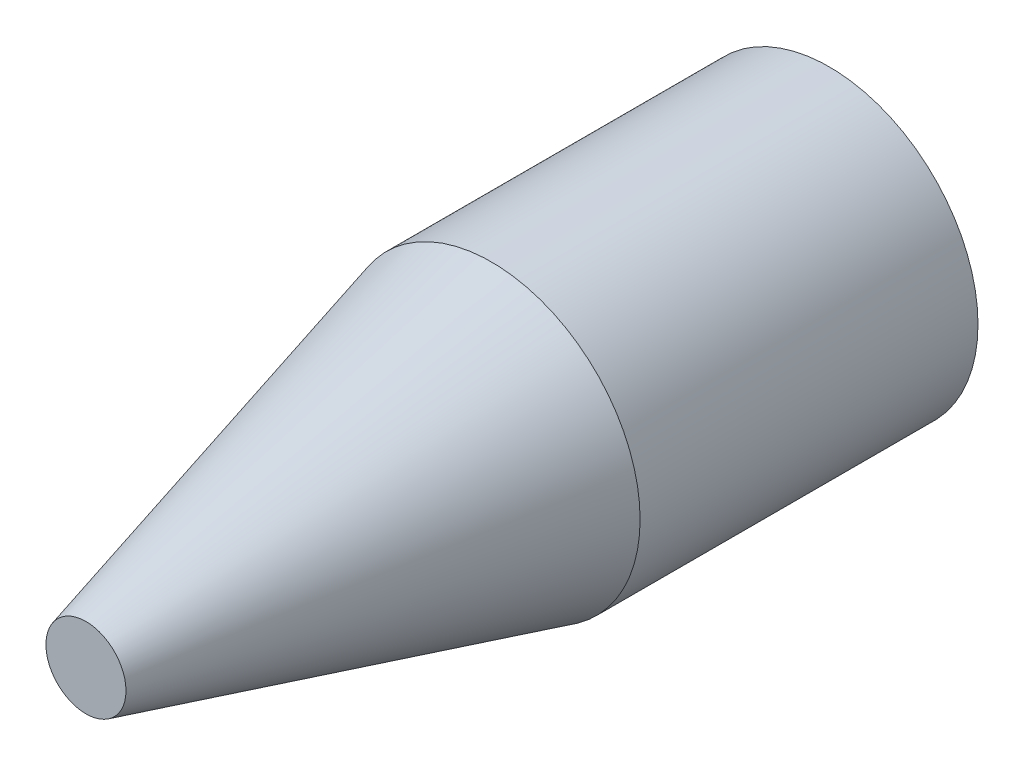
ISO-10303-21;
HEADER;
FILE_DESCRIPTION(('STEP AP214'),'2;1');
FILE_NAME('part.step','',(''),(''),'','','');
FILE_SCHEMA(('AUTOMOTIVE_DESIGN { 1 0 10303 214 1 1 1 1 }'));
ENDSEC;
DATA;
#1=APPLICATION_CONTEXT('core data for automotive mechanical design processes');
#2=APPLICATION_PROTOCOL_DEFINITION('international standard','automotive_design',2000,#1);
#3=PRODUCT_CONTEXT('',#1,'mechanical');
#4=PRODUCT('Part','Part','',(#3));
#5=PRODUCT_RELATED_PRODUCT_CATEGORY('part','',(#4));
#6=PRODUCT_DEFINITION_FORMATION('','',#4);
#7=PRODUCT_DEFINITION_CONTEXT('part definition',#1,'design');
#8=PRODUCT_DEFINITION('design','',#6,#7);
#9=PRODUCT_DEFINITION_SHAPE('','',#8);
#10=(LENGTH_UNIT() NAMED_UNIT(*) SI_UNIT(.MILLI.,.METRE.));
#11=(NAMED_UNIT(*) PLANE_ANGLE_UNIT() SI_UNIT($,.RADIAN.));
#12=(NAMED_UNIT(*) SI_UNIT($,.STERADIAN.) SOLID_ANGLE_UNIT());
#13=UNCERTAINTY_MEASURE_WITH_UNIT(LENGTH_MEASURE(1.E-05),#10,'distance_accuracy_value','');
#14=(GEOMETRIC_REPRESENTATION_CONTEXT(3) GLOBAL_UNCERTAINTY_ASSIGNED_CONTEXT((#13)) GLOBAL_UNIT_ASSIGNED_CONTEXT((#10,
#11,#12)) REPRESENTATION_CONTEXT('',''));
#15=CARTESIAN_POINT('',(0.,0.,0.));
#16=DIRECTION('',(0.,0.,1.));
#17=DIRECTION('',(1.,0.,0.));
#18=AXIS2_PLACEMENT_3D('',#15,#16,#17);
#19=CARTESIAN_POINT('',(0.,0.,0.));
#20=DIRECTION('',(0.,0.,-1.));
#21=DIRECTION('',(1.,0.,0.));
#22=AXIS2_PLACEMENT_3D('',#19,#20,#21);
#23=CONICAL_SURFACE('',#22,110.,0.26179938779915);
#24=CARTESIAN_POINT('',(0.,0.,300.));
#25=DIRECTION('',(0.,0.,1.));
#26=DIRECTION('',(1.,0.,0.));
#27=AXIS2_PLACEMENT_3D('',#24,#25,#26);
#28=CIRCLE('',#27,29.615242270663);
#29=CARTESIAN_POINT('',(29.615242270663,0.,300.));
#30=VERTEX_POINT('',#29);
#31=EDGE_CURVE('E10',#30,#30,#28,.T.);
#32=CARTESIAN_POINT('',(0.,0.,0.));
#33=DIRECTION('',(0.,0.,-1.));
#34=DIRECTION('',(-1.,0.,0.));
#35=AXIS2_PLACEMENT_3D('',#32,#33,#34);
#36=CIRCLE('',#35,110.);
#37=CARTESIAN_POINT('',(110.,0.,0.));
#38=VERTEX_POINT('',#37);
#39=EDGE_CURVE('E376',#38,#38,#36,.T.);
#40=CARTESIAN_POINT('',(29.615242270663,0.,300.));
#41=CARTESIAN_POINT('',(30.4525834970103,0.,296.875));
#42=CARTESIAN_POINT('',(31.2899247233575,0.,293.75));
#43=CARTESIAN_POINT('',(32.9646071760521,0.,287.5));
#44=CARTESIAN_POINT('',(33.8019484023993,0.,284.375));
#45=CARTESIAN_POINT('',(35.4766308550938,0.,278.125));
#46=CARTESIAN_POINT('',(36.3139720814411,0.,275.));
#47=CARTESIAN_POINT('',(37.9886545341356,0.,268.75));
#48=CARTESIAN_POINT('',(38.8259957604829,0.,265.625));
#49=CARTESIAN_POINT('',(40.5006782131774,0.,259.375));
#50=CARTESIAN_POINT('',(41.3380194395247,0.,256.25));
#51=CARTESIAN_POINT('',(43.0127018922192,0.,250.));
#52=CARTESIAN_POINT('',(43.8500431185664,0.,246.875));
#53=CARTESIAN_POINT('',(45.524725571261,0.,240.625));
#54=CARTESIAN_POINT('',(46.3620667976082,0.,237.5));
#55=CARTESIAN_POINT('',(48.0367492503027,0.,231.25));
#56=CARTESIAN_POINT('',(48.87409047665,0.,228.125));
#57=CARTESIAN_POINT('',(50.5487729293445,0.,221.875));
#58=CARTESIAN_POINT('',(51.3861141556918,0.,218.75));
#59=CARTESIAN_POINT('',(53.0607966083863,0.,212.5));
#60=CARTESIAN_POINT('',(53.8981378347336,0.,209.375));
#61=CARTESIAN_POINT('',(55.5728202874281,0.,203.125));
#62=CARTESIAN_POINT('',(56.4101615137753,0.,200.));
#63=CARTESIAN_POINT('',(58.0848439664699,0.,193.75));
#64=CARTESIAN_POINT('',(58.9221851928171,0.,190.625));
#65=CARTESIAN_POINT('',(60.5968676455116,0.,184.375));
#66=CARTESIAN_POINT('',(61.4342088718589,0.,181.25));
#67=CARTESIAN_POINT('',(63.1088913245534,0.,175.));
#68=CARTESIAN_POINT('',(63.9462325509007,0.,171.875));
#69=CARTESIAN_POINT('',(65.6209150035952,0.,165.625));
#70=CARTESIAN_POINT('',(66.4582562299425,0.,162.5));
#71=CARTESIAN_POINT('',(68.132938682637,0.,156.25));
#72=CARTESIAN_POINT('',(68.9702799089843,0.,153.125));
#73=CARTESIAN_POINT('',(70.6449623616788,0.,146.875));
#74=CARTESIAN_POINT('',(71.482303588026,0.,143.75));
#75=CARTESIAN_POINT('',(73.1569860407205,0.,137.5));
#76=CARTESIAN_POINT('',(73.9943272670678,0.,134.375));
#77=CARTESIAN_POINT('',(75.6690097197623,0.,128.125));
#78=CARTESIAN_POINT('',(76.5063509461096,0.,125.));
#79=CARTESIAN_POINT('',(78.1810333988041,0.,118.75));
#80=CARTESIAN_POINT('',(79.0183746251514,0.,115.625));
#81=CARTESIAN_POINT('',(80.6930570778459,0.,109.375));
#82=CARTESIAN_POINT('',(81.5303983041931,0.,106.25));
#83=CARTESIAN_POINT('',(83.2050807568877,0.,100.));
#84=CARTESIAN_POINT('',(84.0424219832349,0.,96.875));
#85=CARTESIAN_POINT('',(85.7171044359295,0.,90.625));
#86=CARTESIAN_POINT('',(86.5544456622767,0.,87.5));
#87=CARTESIAN_POINT('',(88.2291281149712,0.,81.25));
#88=CARTESIAN_POINT('',(89.0664693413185,0.,78.125));
#89=CARTESIAN_POINT('',(90.741151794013,0.,71.875));
#90=CARTESIAN_POINT('',(91.5784930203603,0.,68.75));
#91=CARTESIAN_POINT('',(93.2531754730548,0.,62.5));
#92=CARTESIAN_POINT('',(94.090516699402,0.,59.375));
#93=CARTESIAN_POINT('',(95.7651991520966,0.,53.125));
#94=CARTESIAN_POINT('',(96.6025403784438,0.,50.));
#95=CARTESIAN_POINT('',(98.2772228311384,0.,43.75));
#96=CARTESIAN_POINT('',(99.1145640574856,0.,40.625));
#97=CARTESIAN_POINT('',(100.78924651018,0.,34.375));
#98=CARTESIAN_POINT('',(101.626587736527,0.,31.25));
#99=CARTESIAN_POINT('',(103.301270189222,0.,25.));
#100=CARTESIAN_POINT('',(104.138611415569,0.,21.875));
#101=CARTESIAN_POINT('',(105.813293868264,0.,15.625));
#102=CARTESIAN_POINT('',(106.650635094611,0.,12.5));
#103=CARTESIAN_POINT('',(108.325317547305,0.,6.25000000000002));
#104=CARTESIAN_POINT('',(109.162658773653,0.,3.12500000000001));
#105=CARTESIAN_POINT('',(110.,0.,0.));
#106=B_SPLINE_CURVE_WITH_KNOTS('',3,(#40,#41,#42,#43,#44,#45,#46,#47,#48,#49,#50,#51,#52,#53,
#54,#55,#56,#57,#58,#59,#60,#61,#62,#63,#64,#65,#66,#67,#68,#69,#70,#71,#72,#73,#74,#75,#76,#77,
#78,#79,#80,#81,#82,#83,#84,#85,#86,#87,#88,#89,#90,#91,#92,#93,#94,#95,#96,#97,#98,#99,#100,
#101,#102,#103,#104,#105),.UNSPECIFIED.,.F.,.F.,(4,2,2,2,2,2,2,2,2,2,2,2,2,2,2,2,2,2,2,2,2,2,2,
2,2,2,2,2,2,2,2,2,4),(0.,9.70571419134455,19.411428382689,29.1171425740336,38.8228567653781,
48.5285709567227,58.2342851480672,67.9399993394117,77.6457135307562,87.3514277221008,
97.0571419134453,106.76285610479,116.468570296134,126.174284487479,135.879998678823,
145.585712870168,155.291427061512,164.997141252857,174.702855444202,184.408569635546,
194.114283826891,203.819998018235,213.52571220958,223.231426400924,232.937140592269,
242.642854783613,252.348568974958,262.054283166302,271.759997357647,281.465711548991,
291.171425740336,300.87713993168,310.582854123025),.UNSPECIFIED.);
#107=EDGE_CURVE('BSEAM366',#30,#38,#106,.T.);
#108=ORIENTED_EDGE('',*,*,#31,.F.);
#109=ORIENTED_EDGE('',*,*,#39,.F.);
#110=ORIENTED_EDGE('',*,*,#107,.T.);
#111=ORIENTED_EDGE('',*,*,#107,.F.);
#112=EDGE_LOOP('',(#108,#110,#109,#111));
#113=FACE_BOUND('',#112,.T.);
#114=ADVANCED_FACE('F366',(#113),#23,.T.);
#115=CARTESIAN_POINT('',(0.,0.,300.));
#116=DIRECTION('',(0.,0.,1.));
#117=DIRECTION('',(1.,0.,0.));
#118=AXIS2_PLACEMENT_3D('',#115,#116,#117);
#119=PLANE('',#118);
#120=ORIENTED_EDGE('',*,*,#31,.T.);
#121=EDGE_LOOP('',(#120));
#122=FACE_BOUND('',#121,.T.);
#123=ADVANCED_FACE('F408',(#122),#119,.T.);
#124=CARTESIAN_POINT('',(0.,0.,-250.));
#125=DIRECTION('',(0.,0.,1.));
#126=DIRECTION('',(1.,0.,0.));
#127=AXIS2_PLACEMENT_3D('',#124,#125,#126);
#128=CYLINDRICAL_SURFACE('',#127,110.);
#129=CARTESIAN_POINT('',(0.,0.,-250.));
#130=DIRECTION('',(0.,0.,-1.));
#131=DIRECTION('',(-1.,0.,0.));
#132=AXIS2_PLACEMENT_3D('',#129,#130,#131);
#133=CIRCLE('',#132,110.);
#134=CARTESIAN_POINT('',(-110.,0.,-250.));
#135=VERTEX_POINT('',#134);
#136=EDGE_CURVE('E372',#135,#135,#133,.T.);
#137=ORIENTED_EDGE('',*,*,#136,.F.);
#138=EDGE_LOOP('',(#137));
#139=FACE_BOUND('',#138,.T.);
#140=ORIENTED_EDGE('',*,*,#39,.T.);
#141=EDGE_LOOP('',(#140));
#142=FACE_BOUND('',#141,.T.);
#143=ADVANCED_FACE('F413',(#139,#142),#128,.T.);
#144=CARTESIAN_POINT('',(0.,0.,-250.));
#145=DIRECTION('',(0.,0.,-1.));
#146=DIRECTION('',(-1.,0.,0.));
#147=AXIS2_PLACEMENT_3D('',#144,#145,#146);
#148=PLANE('',#147);
#149=CARTESIAN_POINT('',(0.,0.,-250.));
#150=DIRECTION('',(0.,0.,-1.));
#151=DIRECTION('',(-1.,0.,0.));
#152=AXIS2_PLACEMENT_3D('',#149,#150,#151);
#153=CIRCLE('',#152,105.);
#154=CARTESIAN_POINT('',(-105.,0.,-250.));
#155=VERTEX_POINT('',#154);
#156=EDGE_CURVE('E383',#155,#155,#153,.T.);
#157=ORIENTED_EDGE('',*,*,#156,.F.);
#158=EDGE_LOOP('',(#157));
#159=FACE_BOUND('',#158,.T.);
#160=ORIENTED_EDGE('',*,*,#136,.T.);
#161=EDGE_LOOP('',(#160));
#162=FACE_BOUND('',#161,.T.);
#163=ADVANCED_FACE('F405',(#159,#162),#148,.T.);
#164=CARTESIAN_POINT('',(0.,0.,-1.29409522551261));
#165=DIRECTION('',(0.,0.,-1.));
#166=DIRECTION('',(1.,0.,0.));
#167=AXIS2_PLACEMENT_3D('',#164,#165,#166);
#168=CONICAL_SURFACE('',#167,105.170370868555,0.26179938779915);
#169=CARTESIAN_POINT('',(0.,0.,295.));
#170=DIRECTION('',(0.,0.,1.));
#171=DIRECTION('',(1.,0.,0.));
#172=AXIS2_PLACEMENT_3D('',#169,#170,#171);
#173=CIRCLE('',#172,25.7786073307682);
#174=CARTESIAN_POINT('',(25.7786073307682,0.,295.));
#175=VERTEX_POINT('',#174);
#176=EDGE_CURVE('E380',#175,#175,#173,.T.);
#177=CARTESIAN_POINT('',(0.,0.,-0.658262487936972));
#178=DIRECTION('',(0.,0.,-1.));
#179=DIRECTION('',(-1.,0.,0.));
#180=AXIS2_PLACEMENT_3D('',#177,#178,#179);
#181=CIRCLE('',#180,105.);
#182=CARTESIAN_POINT('',(105.,0.,-0.658262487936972));
#183=VERTEX_POINT('',#182);
#184=EDGE_CURVE('E386',#183,#183,#181,.T.);
#185=CARTESIAN_POINT('',(25.7786073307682,0.,295.));
#186=CARTESIAN_POINT('',(26.6038301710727,0.,291.920226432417));
#187=CARTESIAN_POINT('',(27.4290530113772,0.,288.840452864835));
#188=CARTESIAN_POINT('',(29.0794986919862,0.,282.680905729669));
#189=CARTESIAN_POINT('',(29.9047215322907,0.,279.601132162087));
#190=CARTESIAN_POINT('',(31.5551672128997,0.,273.441585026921));
#191=CARTESIAN_POINT('',(32.3803900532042,0.,270.361811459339));
#192=CARTESIAN_POINT('',(34.0308357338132,0.,264.202264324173));
#193=CARTESIAN_POINT('',(34.8560585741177,0.,261.12249075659));
#194=CARTESIAN_POINT('',(36.5065042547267,0.,254.962943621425));
#195=CARTESIAN_POINT('',(37.3317270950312,0.,251.883170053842));
#196=CARTESIAN_POINT('',(38.9821727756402,0.,245.723622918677));
#197=CARTESIAN_POINT('',(39.8073956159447,0.,242.643849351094));
#198=CARTESIAN_POINT('',(41.4578412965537,0.,236.484302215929));
#199=CARTESIAN_POINT('',(42.2830641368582,0.,233.404528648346));
#200=CARTESIAN_POINT('',(43.9335098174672,0.,227.244981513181));
#201=CARTESIAN_POINT('',(44.7587326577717,0.,224.165207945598));
#202=CARTESIAN_POINT('',(46.4091783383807,0.,218.005660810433));
#203=CARTESIAN_POINT('',(47.2344011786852,0.,214.92588724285));
#204=CARTESIAN_POINT('',(48.8848468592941,0.,208.766340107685));
#205=CARTESIAN_POINT('',(49.7100696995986,0.,205.686566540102));
#206=CARTESIAN_POINT('',(51.3605153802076,0.,199.527019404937));
#207=CARTESIAN_POINT('',(52.1857382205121,0.,196.447245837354));
#208=CARTESIAN_POINT('',(53.8361839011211,0.,190.287698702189));
#209=CARTESIAN_POINT('',(54.6614067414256,0.,187.207925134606));
#210=CARTESIAN_POINT('',(56.3118524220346,0.,181.048377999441));
#211=CARTESIAN_POINT('',(57.1370752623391,0.,177.968604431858));
#212=CARTESIAN_POINT('',(58.7875209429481,0.,171.809057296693));
#213=CARTESIAN_POINT('',(59.6127437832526,0.,168.72928372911));
#214=CARTESIAN_POINT('',(61.2631894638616,0.,162.569736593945));
#215=CARTESIAN_POINT('',(62.0884123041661,0.,159.489963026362));
#216=CARTESIAN_POINT('',(63.7388579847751,0.,153.330415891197));
#217=CARTESIAN_POINT('',(64.5640808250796,0.,150.250642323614));
#218=CARTESIAN_POINT('',(66.2145265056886,0.,144.091095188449));
#219=CARTESIAN_POINT('',(67.0397493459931,0.,141.011321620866));
#220=CARTESIAN_POINT('',(68.6901950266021,0.,134.851774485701));
#221=CARTESIAN_POINT('',(69.5154178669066,0.,131.772000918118));
#222=CARTESIAN_POINT('',(71.1658635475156,0.,125.612453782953));
#223=CARTESIAN_POINT('',(71.9910863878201,0.,122.53268021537));
#224=CARTESIAN_POINT('',(73.6415320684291,0.,116.373133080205));
#225=CARTESIAN_POINT('',(74.4667549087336,0.,113.293359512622));
#226=CARTESIAN_POINT('',(76.1172005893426,0.,107.133812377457));
#227=CARTESIAN_POINT('',(76.9424234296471,0.,104.054038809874));
#228=CARTESIAN_POINT('',(78.5928691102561,0.,97.8944916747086));
#229=CARTESIAN_POINT('',(79.4180919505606,0.,94.814718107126));
#230=CARTESIAN_POINT('',(81.0685376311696,0.,88.6551709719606));
#231=CARTESIAN_POINT('',(81.8937604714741,0.,85.5753974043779));
#232=CARTESIAN_POINT('',(83.544206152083,0.,79.4158502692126));
#233=CARTESIAN_POINT('',(84.3694289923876,0.,76.3360767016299));
#234=CARTESIAN_POINT('',(86.0198746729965,0.,70.1765295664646));
#235=CARTESIAN_POINT('',(86.8450975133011,0.,67.0967559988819));
#236=CARTESIAN_POINT('',(88.49554319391,0.,60.9372088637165));
#237=CARTESIAN_POINT('',(89.3207660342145,0.,57.8574352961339));
#238=CARTESIAN_POINT('',(90.9712117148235,0.,51.6978881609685));
#239=CARTESIAN_POINT('',(91.796434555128,0.,48.6181145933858));
#240=CARTESIAN_POINT('',(93.446880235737,0.,42.4585674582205));
#241=CARTESIAN_POINT('',(94.2721030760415,0.,39.3787938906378));
#242=CARTESIAN_POINT('',(95.9225487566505,0.,33.2192467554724));
#243=CARTESIAN_POINT('',(96.747771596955,0.,30.1394731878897));
#244=CARTESIAN_POINT('',(98.398217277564,0.,23.9799260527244));
#245=CARTESIAN_POINT('',(99.2234401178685,0.,20.9001524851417));
#246=CARTESIAN_POINT('',(100.873885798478,0.,14.7406053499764));
#247=CARTESIAN_POINT('',(101.699108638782,0.,11.6608317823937));
#248=CARTESIAN_POINT('',(103.349554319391,0.,5.50128464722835));
#249=CARTESIAN_POINT('',(104.174777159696,0.,2.42151107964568));
#250=CARTESIAN_POINT('',(105.,0.,-0.658262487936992));
#251=B_SPLINE_CURVE_WITH_KNOTS('',3,(#185,#186,#187,#188,#189,#190,#191,#192,#193,#194,#195,
#196,#197,#198,#199,#200,#201,#202,#203,#204,#205,#206,#207,#208,#209,#210,#211,#212,#213,#214,
#215,#216,#217,#218,#219,#220,#221,#222,#223,#224,#225,#226,#227,#228,#229,#230,#231,#232,#233,
#234,#235,#236,#237,#238,#239,#240,#241,#242,#243,#244,#245,#246,#247,#248,#249,#250),
.UNSPECIFIED.,.F.,.F.,(4,2,2,2,2,2,2,2,2,2,2,2,2,2,2,2,2,2,2,2,2,2,2,2,2,2,2,2,2,2,2,2,4),(0.,
9.56524864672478,19.1304972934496,28.6957459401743,38.2609945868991,47.8262432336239,
57.3914918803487,66.9567405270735,76.5219891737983,86.0872378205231,95.6524864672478,
105.217735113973,114.782983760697,124.348232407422,133.913481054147,143.478729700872,
153.043978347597,162.609226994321,172.174475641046,181.739724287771,191.304972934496,
200.870221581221,210.435470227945,220.00071887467,229.565967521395,239.13121616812,
248.696464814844,258.261713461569,267.826962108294,277.392210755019,286.957459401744,
296.522708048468,306.087956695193),.UNSPECIFIED.);
#252=EDGE_CURVE('BSEAM392',#175,#183,#251,.T.);
#253=ORIENTED_EDGE('',*,*,#176,.T.);
#254=ORIENTED_EDGE('',*,*,#184,.T.);
#255=ORIENTED_EDGE('',*,*,#252,.T.);
#256=ORIENTED_EDGE('',*,*,#252,.F.);
#257=EDGE_LOOP('',(#253,#255,#254,#256));
#258=FACE_BOUND('',#257,.T.);
#259=ADVANCED_FACE('F392',(#258),#168,.F.);
#260=CARTESIAN_POINT('',(0.,0.,295.));
#261=DIRECTION('',(0.,0.,1.));
#262=DIRECTION('',(1.,0.,0.));
#263=AXIS2_PLACEMENT_3D('',#260,#261,#262);
#264=PLANE('',#263);
#265=ORIENTED_EDGE('',*,*,#176,.F.);
#266=EDGE_LOOP('',(#265));
#267=FACE_BOUND('',#266,.T.);
#268=ADVANCED_FACE('F395',(#267),#264,.F.);
#269=CARTESIAN_POINT('',(0.,0.,-250.));
#270=DIRECTION('',(0.,0.,1.));
#271=DIRECTION('',(1.,0.,0.));
#272=AXIS2_PLACEMENT_3D('',#269,#270,#271);
#273=CYLINDRICAL_SURFACE('',#272,105.);
#274=ORIENTED_EDGE('',*,*,#156,.T.);
#275=EDGE_LOOP('',(#274));
#276=FACE_BOUND('',#275,.T.);
#277=ORIENTED_EDGE('',*,*,#184,.F.);
#278=EDGE_LOOP('',(#277));
#279=FACE_BOUND('',#278,.T.);
#280=ADVANCED_FACE('F397',(#276,#279),#273,.F.);
#281=CLOSED_SHELL('',(#114,#123,#143,#163,#259,#268,#280));
#282=MANIFOLD_SOLID_BREP('B2',#281);
#283=ADVANCED_BREP_SHAPE_REPRESENTATION('',(#18,#282),#14);
#284=SHAPE_DEFINITION_REPRESENTATION(#9,#283);
ENDSEC;
END-ISO-10303-21;
